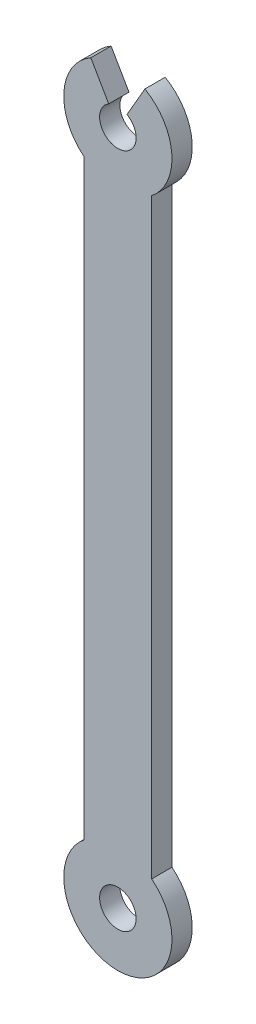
from build123d import *

# Parameters (mm, degrees)
SKETCH_1_R      = 1.35
EXTRUDE_1_DEPTH = 1.5


with BuildPart() as part:
    # Sketch 1 → Extrude 1 (new body)
    with BuildSketch(Plane.XY):
        with BuildLine():
            Line((-2.5, -3.122498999), (-2.5, -46.877501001))
            ThreePointArc((-2.5, -46.877501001), (0, -54), (2.5, -46.877501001))
            Line((2.5, -46.877501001), (2.5, -3.122498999))
            ThreePointArc((2.5, -3.122498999), (3.988524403, 0.302775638), (2, 3.464101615))
            Line((2, 3.464101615), (0.675, 1.169134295))
            ThreePointArc((0.675, 1.169134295), (1.169134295, 0.675), (1.35, 0))
            ThreePointArc((1.35, 0), (-0.675, -1.169134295), (-0.675, 1.169134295))
            Line((-0.675, 1.169134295), (-2, 3.464101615))
            ThreePointArc((-2, 3.464101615), (-3.988524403, 0.302775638), (-2.5, -3.122498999))
        make_face()
        with Locations((0, -50)):
            Circle(SKETCH_1_R, mode=Mode.SUBTRACT)
    extrude(amount=EXTRUDE_1_DEPTH)


solid = part.part
